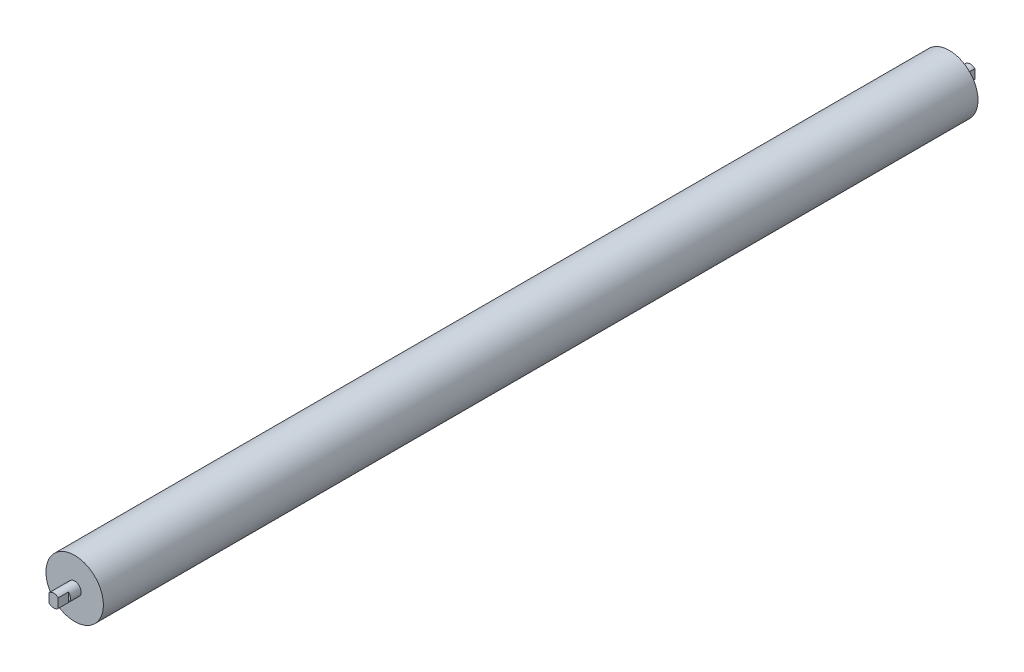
ISO-10303-21;
HEADER;
FILE_DESCRIPTION(('STEP AP214'),'2;1');
FILE_NAME('part.step','',(''),(''),'','','');
FILE_SCHEMA(('AUTOMOTIVE_DESIGN { 1 0 10303 214 1 1 1 1 }'));
ENDSEC;
DATA;
#1=APPLICATION_CONTEXT('core data for automotive mechanical design processes');
#2=APPLICATION_PROTOCOL_DEFINITION('international standard','automotive_design',2000,#1);
#3=PRODUCT_CONTEXT('',#1,'mechanical');
#4=PRODUCT('Part','Part','',(#3));
#5=PRODUCT_RELATED_PRODUCT_CATEGORY('part','',(#4));
#6=PRODUCT_DEFINITION_FORMATION('','',#4);
#7=PRODUCT_DEFINITION_CONTEXT('part definition',#1,'design');
#8=PRODUCT_DEFINITION('design','',#6,#7);
#9=PRODUCT_DEFINITION_SHAPE('','',#8);
#10=(LENGTH_UNIT() NAMED_UNIT(*) SI_UNIT(.MILLI.,.METRE.));
#11=(NAMED_UNIT(*) PLANE_ANGLE_UNIT() SI_UNIT($,.RADIAN.));
#12=(NAMED_UNIT(*) SI_UNIT($,.STERADIAN.) SOLID_ANGLE_UNIT());
#13=UNCERTAINTY_MEASURE_WITH_UNIT(LENGTH_MEASURE(1.E-05),#10,'distance_accuracy_value','');
#14=(GEOMETRIC_REPRESENTATION_CONTEXT(3) GLOBAL_UNCERTAINTY_ASSIGNED_CONTEXT((#13)) GLOBAL_UNIT_ASSIGNED_CONTEXT((#10,
#11,#12)) REPRESENTATION_CONTEXT('',''));
#15=CARTESIAN_POINT('',(0.,0.,0.));
#16=DIRECTION('',(0.,0.,1.));
#17=DIRECTION('',(1.,0.,0.));
#18=AXIS2_PLACEMENT_3D('',#15,#16,#17);
#19=CARTESIAN_POINT('',(0.,0.,0.));
#20=DIRECTION('',(0.,0.,1.));
#21=DIRECTION('',(1.,0.,0.));
#22=AXIS2_PLACEMENT_3D('',#19,#20,#21);
#23=PLANE('',#22);
#24=DIRECTION('',(0.,-1.,0.));
#25=VECTOR('',#24,1.);
#26=CARTESIAN_POINT('',(7.,7.14142842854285,0.));
#27=LINE('',#26,#25);
#28=CARTESIAN_POINT('',(7.,7.14142842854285,0.));
#29=VERTEX_POINT('',#28);
#30=CARTESIAN_POINT('',(7.,-7.14142842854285,0.));
#31=VERTEX_POINT('',#30);
#32=EDGE_CURVE('E97',#29,#31,#27,.T.);
#33=ORIENTED_EDGE('',*,*,#32,.T.);
#34=CARTESIAN_POINT('',(0.,0.,0.));
#35=DIRECTION('',(0.,0.,1.));
#36=DIRECTION('',(1.,0.,0.));
#37=AXIS2_PLACEMENT_3D('',#34,#35,#36);
#38=CIRCLE('',#37,10.);
#39=CARTESIAN_POINT('',(-7.,-7.14142842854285,0.));
#40=VERTEX_POINT('',#39);
#41=EDGE_CURVE('E116',#40,#31,#38,.T.);
#42=ORIENTED_EDGE('',*,*,#41,.F.);
#43=DIRECTION('',(0.,1.,0.));
#44=VECTOR('',#43,1.);
#45=CARTESIAN_POINT('',(-7.,7.14142842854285,0.));
#46=LINE('',#45,#44);
#47=CARTESIAN_POINT('',(-7.,7.14142842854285,0.));
#48=VERTEX_POINT('',#47);
#49=EDGE_CURVE('E107',#40,#48,#46,.T.);
#50=ORIENTED_EDGE('',*,*,#49,.T.);
#51=EDGE_CURVE('E113',#29,#48,#38,.T.);
#52=ORIENTED_EDGE('',*,*,#51,.F.);
#53=EDGE_LOOP('',(#33,#42,#50,#52));
#54=FACE_BOUND('',#53,.T.);
#55=ADVANCED_FACE('F34',(#54),#23,.F.);
#56=CARTESIAN_POINT('',(0.,0.,1420.));
#57=DIRECTION('',(0.,0.,-1.));
#58=DIRECTION('',(-1.,0.,0.));
#59=AXIS2_PLACEMENT_3D('',#56,#57,#58);
#60=CYLINDRICAL_SURFACE('',#59,10.);
#61=CARTESIAN_POINT('',(0.,0.,1387.5));
#62=DIRECTION('',(0.,0.,1.));
#63=DIRECTION('',(1.,0.,0.));
#64=AXIS2_PLACEMENT_3D('',#61,#62,#63);
#65=CIRCLE('',#64,10.);
#66=CARTESIAN_POINT('',(10.,0.,1387.5));
#67=VERTEX_POINT('',#66);
#68=EDGE_CURVE('E159',#67,#67,#65,.T.);
#69=ORIENTED_EDGE('',*,*,#68,.T.);
#70=EDGE_LOOP('',(#69));
#71=FACE_BOUND('',#70,.T.);
#72=CARTESIAN_POINT('',(0.,0.,1404.));
#73=DIRECTION('',(0.,0.,1.));
#74=DIRECTION('',(1.,0.,0.));
#75=AXIS2_PLACEMENT_3D('',#72,#73,#74);
#76=CIRCLE('',#75,10.);
#77=CARTESIAN_POINT('',(-7.,7.14142842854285,1404.));
#78=VERTEX_POINT('',#77);
#79=CARTESIAN_POINT('',(-7.,-7.14142842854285,1404.));
#80=VERTEX_POINT('',#79);
#81=EDGE_CURVE('E124',#78,#80,#76,.T.);
#82=ORIENTED_EDGE('',*,*,#81,.F.);
#83=DIRECTION('',(0.,0.,1.));
#84=VECTOR('',#83,1.);
#85=CARTESIAN_POINT('',(-7.,7.14142842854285,1404.));
#86=LINE('',#85,#84);
#87=CARTESIAN_POINT('',(-7.,7.14142842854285,1420.));
#88=VERTEX_POINT('',#87);
#89=EDGE_CURVE('E160',#78,#88,#86,.T.);
#90=ORIENTED_EDGE('',*,*,#89,.T.);
#91=CARTESIAN_POINT('',(0.,0.,1420.));
#92=DIRECTION('',(0.,0.,1.));
#93=DIRECTION('',(1.,0.,0.));
#94=AXIS2_PLACEMENT_3D('',#91,#92,#93);
#95=CIRCLE('',#94,10.);
#96=CARTESIAN_POINT('',(7.,7.14142842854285,1420.));
#97=VERTEX_POINT('',#96);
#98=EDGE_CURVE('E170',#97,#88,#95,.T.);
#99=ORIENTED_EDGE('',*,*,#98,.F.);
#100=DIRECTION('',(0.,0.,1.));
#101=VECTOR('',#100,1.);
#102=CARTESIAN_POINT('',(7.,7.14142842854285,1404.));
#103=LINE('',#102,#101);
#104=CARTESIAN_POINT('',(7.,7.14142842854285,1404.));
#105=VERTEX_POINT('',#104);
#106=EDGE_CURVE('E163',#105,#97,#103,.T.);
#107=ORIENTED_EDGE('',*,*,#106,.F.);
#108=CARTESIAN_POINT('',(7.,-7.14142842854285,1404.));
#109=VERTEX_POINT('',#108);
#110=EDGE_CURVE('E119',#109,#105,#76,.T.);
#111=ORIENTED_EDGE('',*,*,#110,.F.);
#112=DIRECTION('',(0.,0.,1.));
#113=VECTOR('',#112,1.);
#114=CARTESIAN_POINT('',(7.,-7.14142842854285,1404.));
#115=LINE('',#114,#113);
#116=CARTESIAN_POINT('',(7.,-7.14142842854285,1420.));
#117=VERTEX_POINT('',#116);
#118=EDGE_CURVE('E156',#109,#117,#115,.T.);
#119=ORIENTED_EDGE('',*,*,#118,.T.);
#120=CARTESIAN_POINT('',(-7.,-7.14142842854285,1420.));
#121=VERTEX_POINT('',#120);
#122=EDGE_CURVE('E169',#121,#117,#95,.T.);
#123=ORIENTED_EDGE('',*,*,#122,.F.);
#124=DIRECTION('',(0.,0.,1.));
#125=VECTOR('',#124,1.);
#126=CARTESIAN_POINT('',(-7.,-7.14142842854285,1404.));
#127=LINE('',#126,#125);
#128=EDGE_CURVE('E157',#80,#121,#127,.T.);
#129=ORIENTED_EDGE('',*,*,#128,.F.);
#130=EDGE_LOOP('',(#82,#90,#99,#107,#111,#119,#123,#129));
#131=FACE_BOUND('',#130,.T.);
#132=ADVANCED_FACE('F198',(#71,#131),#60,.T.);
#133=CARTESIAN_POINT('',(0.,0.,1420.));
#134=DIRECTION('',(0.,0.,1.));
#135=DIRECTION('',(1.,0.,0.));
#136=AXIS2_PLACEMENT_3D('',#133,#134,#135);
#137=PLANE('',#136);
#138=ORIENTED_EDGE('',*,*,#98,.T.);
#139=DIRECTION('',(0.,-1.,0.));
#140=VECTOR('',#139,1.);
#141=CARTESIAN_POINT('',(-7.,7.14142842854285,1420.));
#142=LINE('',#141,#140);
#143=EDGE_CURVE('E149',#88,#121,#142,.T.);
#144=ORIENTED_EDGE('',*,*,#143,.T.);
#145=ORIENTED_EDGE('',*,*,#122,.T.);
#146=DIRECTION('',(0.,1.,0.));
#147=VECTOR('',#146,1.);
#148=CARTESIAN_POINT('',(7.,7.14142842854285,1420.));
#149=LINE('',#148,#147);
#150=EDGE_CURVE('E146',#117,#97,#149,.T.);
#151=ORIENTED_EDGE('',*,*,#150,.T.);
#152=EDGE_LOOP('',(#138,#144,#145,#151));
#153=FACE_BOUND('',#152,.T.);
#154=ADVANCED_FACE('F202',(#153),#137,.T.);
#155=CARTESIAN_POINT('',(0.,0.,1387.5));
#156=DIRECTION('',(0.,0.,1.));
#157=DIRECTION('',(1.,0.,0.));
#158=AXIS2_PLACEMENT_3D('',#155,#156,#157);
#159=PLANE('',#158);
#160=CARTESIAN_POINT('',(0.,0.,1387.5));
#161=DIRECTION('',(0.,0.,1.));
#162=DIRECTION('',(1.,0.,0.));
#163=AXIS2_PLACEMENT_3D('',#160,#161,#162);
#164=CIRCLE('',#163,44.5);
#165=CARTESIAN_POINT('',(44.5,0.,1387.5));
#166=VERTEX_POINT('',#165);
#167=EDGE_CURVE('E121',#166,#166,#164,.T.);
#168=ORIENTED_EDGE('',*,*,#167,.T.);
#169=EDGE_LOOP('',(#168));
#170=FACE_BOUND('',#169,.T.);
#171=ORIENTED_EDGE('',*,*,#68,.F.);
#172=EDGE_LOOP('',(#171));
#173=FACE_BOUND('',#172,.T.);
#174=ADVANCED_FACE('F179',(#170,#173),#159,.T.);
#175=CARTESIAN_POINT('',(0.,0.,32.5));
#176=DIRECTION('',(0.,0.,-1.));
#177=DIRECTION('',(-1.,0.,0.));
#178=AXIS2_PLACEMENT_3D('',#175,#176,#177);
#179=CYLINDRICAL_SURFACE('',#178,10.);
#180=DIRECTION('',(0.,0.,-1.));
#181=VECTOR('',#180,1.);
#182=CARTESIAN_POINT('',(7.,-7.14142842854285,16.));
#183=LINE('',#182,#181);
#184=CARTESIAN_POINT('',(7.,-7.14142842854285,16.));
#185=VERTEX_POINT('',#184);
#186=EDGE_CURVE('E49',#185,#31,#183,.T.);
#187=ORIENTED_EDGE('',*,*,#186,.F.);
#188=CARTESIAN_POINT('',(0.,0.,16.));
#189=DIRECTION('',(0.,0.,-1.));
#190=DIRECTION('',(-1.,0.,0.));
#191=AXIS2_PLACEMENT_3D('',#188,#189,#190);
#192=CIRCLE('',#191,10.);
#193=CARTESIAN_POINT('',(7.,7.14142842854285,16.));
#194=VERTEX_POINT('',#193);
#195=EDGE_CURVE('E12',#194,#185,#192,.T.);
#196=ORIENTED_EDGE('',*,*,#195,.F.);
#197=DIRECTION('',(0.,0.,-1.));
#198=VECTOR('',#197,1.);
#199=CARTESIAN_POINT('',(7.,7.14142842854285,16.));
#200=LINE('',#199,#198);
#201=EDGE_CURVE('E100',#194,#29,#200,.T.);
#202=ORIENTED_EDGE('',*,*,#201,.T.);
#203=ORIENTED_EDGE('',*,*,#51,.T.);
#204=DIRECTION('',(0.,0.,-1.));
#205=VECTOR('',#204,1.);
#206=CARTESIAN_POINT('',(-7.,7.14142842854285,16.));
#207=LINE('',#206,#205);
#208=CARTESIAN_POINT('',(-7.,7.14142842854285,16.));
#209=VERTEX_POINT('',#208);
#210=EDGE_CURVE('E57',#209,#48,#207,.T.);
#211=ORIENTED_EDGE('',*,*,#210,.F.);
#212=CARTESIAN_POINT('',(-7.,-7.14142842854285,16.));
#213=VERTEX_POINT('',#212);
#214=EDGE_CURVE('E38',#213,#209,#192,.T.);
#215=ORIENTED_EDGE('',*,*,#214,.F.);
#216=DIRECTION('',(0.,0.,-1.));
#217=VECTOR('',#216,1.);
#218=CARTESIAN_POINT('',(-7.,-7.14142842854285,16.));
#219=LINE('',#218,#217);
#220=EDGE_CURVE('E139',#213,#40,#219,.T.);
#221=ORIENTED_EDGE('',*,*,#220,.T.);
#222=ORIENTED_EDGE('',*,*,#41,.T.);
#223=EDGE_LOOP('',(#187,#196,#202,#203,#211,#215,#221,#222));
#224=FACE_BOUND('',#223,.T.);
#225=CARTESIAN_POINT('',(0.,0.,32.5));
#226=DIRECTION('',(0.,0.,1.));
#227=DIRECTION('',(1.,0.,0.));
#228=AXIS2_PLACEMENT_3D('',#225,#226,#227);
#229=CIRCLE('',#228,10.);
#230=CARTESIAN_POINT('',(10.,0.,32.5));
#231=VERTEX_POINT('',#230);
#232=EDGE_CURVE('E115',#231,#231,#229,.T.);
#233=ORIENTED_EDGE('',*,*,#232,.F.);
#234=EDGE_LOOP('',(#233));
#235=FACE_BOUND('',#234,.T.);
#236=ADVANCED_FACE('F36',(#224,#235),#179,.T.);
#237=CARTESIAN_POINT('',(0.,0.,32.5));
#238=DIRECTION('',(0.,0.,1.));
#239=DIRECTION('',(1.,0.,0.));
#240=AXIS2_PLACEMENT_3D('',#237,#238,#239);
#241=PLANE('',#240);
#242=CARTESIAN_POINT('',(0.,0.,32.5));
#243=DIRECTION('',(0.,0.,1.));
#244=DIRECTION('',(1.,0.,0.));
#245=AXIS2_PLACEMENT_3D('',#242,#243,#244);
#246=CIRCLE('',#245,44.5);
#247=CARTESIAN_POINT('',(44.5,0.,32.5));
#248=VERTEX_POINT('',#247);
#249=EDGE_CURVE('E172',#248,#248,#246,.T.);
#250=ORIENTED_EDGE('',*,*,#249,.F.);
#251=EDGE_LOOP('',(#250));
#252=FACE_BOUND('',#251,.T.);
#253=ORIENTED_EDGE('',*,*,#232,.T.);
#254=EDGE_LOOP('',(#253));
#255=FACE_BOUND('',#254,.T.);
#256=ADVANCED_FACE('F185',(#252,#255),#241,.F.);
#257=CARTESIAN_POINT('',(0.,0.,1387.5));
#258=DIRECTION('',(0.,0.,-1.));
#259=DIRECTION('',(-1.,0.,0.));
#260=AXIS2_PLACEMENT_3D('',#257,#258,#259);
#261=CYLINDRICAL_SURFACE('',#260,44.5);
#262=ORIENTED_EDGE('',*,*,#167,.F.);
#263=EDGE_LOOP('',(#262));
#264=FACE_BOUND('',#263,.T.);
#265=ORIENTED_EDGE('',*,*,#249,.T.);
#266=EDGE_LOOP('',(#265));
#267=FACE_BOUND('',#266,.T.);
#268=ADVANCED_FACE('F182',(#264,#267),#261,.T.);
#269=CARTESIAN_POINT('',(7.,7.14142842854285,1404.));
#270=DIRECTION('',(1.,0.,0.));
#271=DIRECTION('',(0.,1.,0.));
#272=AXIS2_PLACEMENT_3D('',#269,#270,#271);
#273=PLANE('',#272);
#274=ORIENTED_EDGE('',*,*,#150,.F.);
#275=ORIENTED_EDGE('',*,*,#118,.F.);
#276=DIRECTION('',(0.,1.,0.));
#277=VECTOR('',#276,1.);
#278=CARTESIAN_POINT('',(7.,7.14142842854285,1404.));
#279=LINE('',#278,#277);
#280=EDGE_CURVE('E152',#109,#105,#279,.T.);
#281=ORIENTED_EDGE('',*,*,#280,.T.);
#282=ORIENTED_EDGE('',*,*,#106,.T.);
#283=EDGE_LOOP('',(#274,#275,#281,#282));
#284=FACE_BOUND('',#283,.T.);
#285=ADVANCED_FACE('F184',(#284),#273,.T.);
#286=CARTESIAN_POINT('',(0.,0.,1404.));
#287=DIRECTION('',(0.,0.,1.));
#288=DIRECTION('',(1.,0.,0.));
#289=AXIS2_PLACEMENT_3D('',#286,#287,#288);
#290=PLANE('',#289);
#291=ORIENTED_EDGE('',*,*,#110,.T.);
#292=ORIENTED_EDGE('',*,*,#280,.F.);
#293=EDGE_LOOP('',(#291,#292));
#294=FACE_BOUND('',#293,.T.);
#295=ADVANCED_FACE('F191',(#294),#290,.T.);
#296=ORIENTED_EDGE('',*,*,#81,.T.);
#297=DIRECTION('',(0.,-1.,0.));
#298=VECTOR('',#297,1.);
#299=CARTESIAN_POINT('',(-7.,7.14142842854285,1404.));
#300=LINE('',#299,#298);
#301=EDGE_CURVE('E154',#78,#80,#300,.T.);
#302=ORIENTED_EDGE('',*,*,#301,.F.);
#303=EDGE_LOOP('',(#296,#302));
#304=FACE_BOUND('',#303,.T.);
#305=ADVANCED_FACE('F256',(#304),#290,.T.);
#306=CARTESIAN_POINT('',(-7.,7.14142842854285,1404.));
#307=DIRECTION('',(-1.,0.,0.));
#308=DIRECTION('',(0.,-1.,0.));
#309=AXIS2_PLACEMENT_3D('',#306,#307,#308);
#310=PLANE('',#309);
#311=ORIENTED_EDGE('',*,*,#143,.F.);
#312=ORIENTED_EDGE('',*,*,#89,.F.);
#313=ORIENTED_EDGE('',*,*,#301,.T.);
#314=ORIENTED_EDGE('',*,*,#128,.T.);
#315=EDGE_LOOP('',(#311,#312,#313,#314));
#316=FACE_BOUND('',#315,.T.);
#317=ADVANCED_FACE('F264',(#316),#310,.T.);
#318=CARTESIAN_POINT('',(-7.,7.14142842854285,16.));
#319=DIRECTION('',(-1.,0.,0.));
#320=DIRECTION('',(0.,-1.,0.));
#321=AXIS2_PLACEMENT_3D('',#318,#319,#320);
#322=PLANE('',#321);
#323=ORIENTED_EDGE('',*,*,#49,.F.);
#324=ORIENTED_EDGE('',*,*,#220,.F.);
#325=DIRECTION('',(0.,1.,0.));
#326=VECTOR('',#325,1.);
#327=CARTESIAN_POINT('',(-7.,7.14142842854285,16.));
#328=LINE('',#327,#326);
#329=EDGE_CURVE('E106',#213,#209,#328,.T.);
#330=ORIENTED_EDGE('',*,*,#329,.T.);
#331=ORIENTED_EDGE('',*,*,#210,.T.);
#332=EDGE_LOOP('',(#323,#324,#330,#331));
#333=FACE_BOUND('',#332,.T.);
#334=ADVANCED_FACE('F138',(#333),#322,.T.);
#335=CARTESIAN_POINT('',(0.,0.,16.));
#336=DIRECTION('',(0.,0.,-1.));
#337=DIRECTION('',(-1.,0.,0.));
#338=AXIS2_PLACEMENT_3D('',#335,#336,#337);
#339=PLANE('',#338);
#340=ORIENTED_EDGE('',*,*,#214,.T.);
#341=ORIENTED_EDGE('',*,*,#329,.F.);
#342=EDGE_LOOP('',(#340,#341));
#343=FACE_BOUND('',#342,.T.);
#344=ADVANCED_FACE('F136',(#343),#339,.T.);
#345=ORIENTED_EDGE('',*,*,#195,.T.);
#346=DIRECTION('',(0.,-1.,0.));
#347=VECTOR('',#346,1.);
#348=CARTESIAN_POINT('',(7.,7.14142842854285,16.));
#349=LINE('',#348,#347);
#350=EDGE_CURVE('E140',#194,#185,#349,.T.);
#351=ORIENTED_EDGE('',*,*,#350,.F.);
#352=EDGE_LOOP('',(#345,#351));
#353=FACE_BOUND('',#352,.T.);
#354=ADVANCED_FACE('F292',(#353),#339,.T.);
#355=CARTESIAN_POINT('',(7.,7.14142842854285,16.));
#356=DIRECTION('',(1.,0.,0.));
#357=DIRECTION('',(0.,1.,0.));
#358=AXIS2_PLACEMENT_3D('',#355,#356,#357);
#359=PLANE('',#358);
#360=ORIENTED_EDGE('',*,*,#32,.F.);
#361=ORIENTED_EDGE('',*,*,#201,.F.);
#362=ORIENTED_EDGE('',*,*,#350,.T.);
#363=ORIENTED_EDGE('',*,*,#186,.T.);
#364=EDGE_LOOP('',(#360,#361,#362,#363));
#365=FACE_BOUND('',#364,.T.);
#366=ADVANCED_FACE('F99',(#365),#359,.T.);
#367=CLOSED_SHELL('',(#55,#132,#154,#174,#236,#256,#268,#285,#295,#305,#317,#334,#344,#354,#366));
#368=MANIFOLD_SOLID_BREP('B2',#367);
#369=ADVANCED_BREP_SHAPE_REPRESENTATION('',(#18,#368),#14);
#370=SHAPE_DEFINITION_REPRESENTATION(#9,#369);
ENDSEC;
END-ISO-10303-21;
